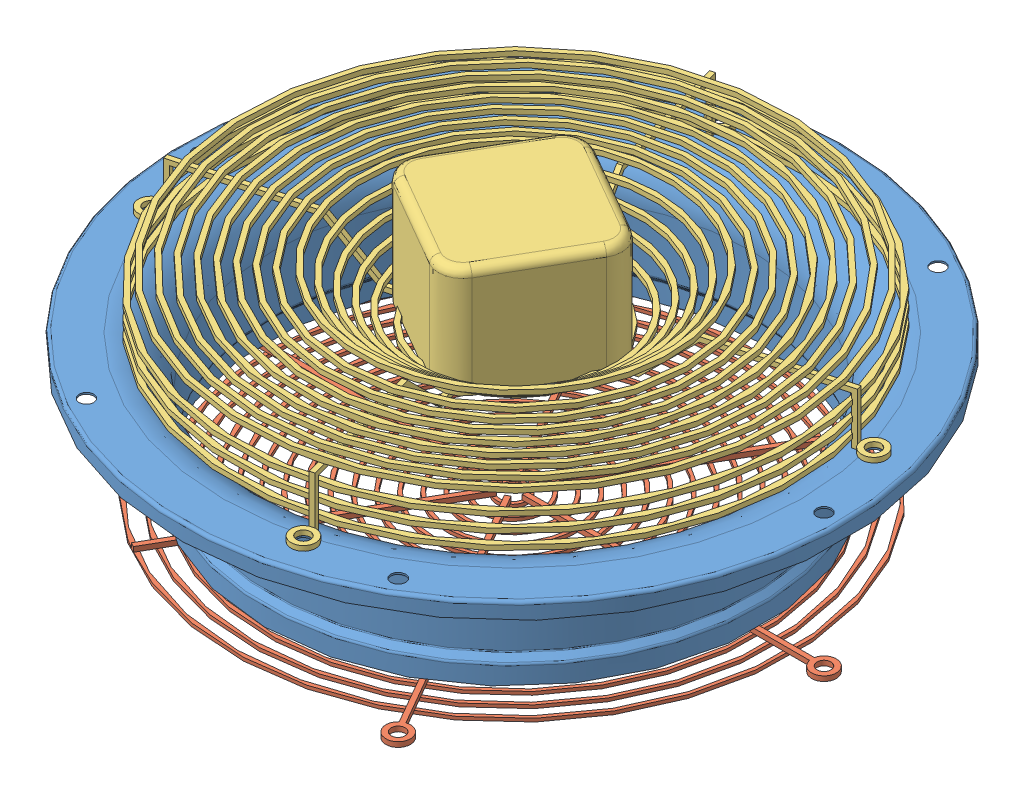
SolidWorks assembly 4740.sldasm, configuration Défaut (file format 3400). Lengths in mm.
Overall size (467.49 156 465.63).
3 component instances, 3 part files, 6 mates.
Components (placement in the parent):
- 4740-1: 4740.sldprt [Défaut] at origin size (402 80.01 402)
- 4740-GRILLE-1: 4740-GRILLE.sldprt [Défaut] at (0 -6 0) x (-0.5 0 0.866025) z (-0.866025 0 -0.5) size (339 5 344.09)
- 4740-GRILLE D-1: 4740-GRILLE D.sldprt [Défaut] at (0 114 0) x (0.258819 0 0.965926) z (0.965926 0 -0.258819) size (375 70 375)
Mates (geometry in assembly coordinates):
- Coïncidente2: coincident aligned: axis of 4740-1; axis of 4740-GRILLE-1
- Distance1: distance = 80 mm anti-aligned: plane of 4740-1 through (-176 79 0) normal (0 -1 0); plane of 4740-GRILLE-1 through (-95 -1 164.5448) normal (0 1 0)
- Coaxiale1: concentric anti-aligned: cylinder of 4740-1; cylinder of 4740-GRILLE-1
- Coïncidente3: coincident anti-aligned: plane of 4740-1 through (-176 80 0) normal (0 1 0); plane of 4740-GRILLE D-1 through (-46.5874 80 -173.8666) normal (0 -1 0)
- Coaxiale7: concentric anti-aligned: circle of 4740-1; circle of 4740-GRILLE D-1
- Coaxiale8: concentric anti-aligned: circle of 4740-1; circle of 4740-GRILLE D-1
